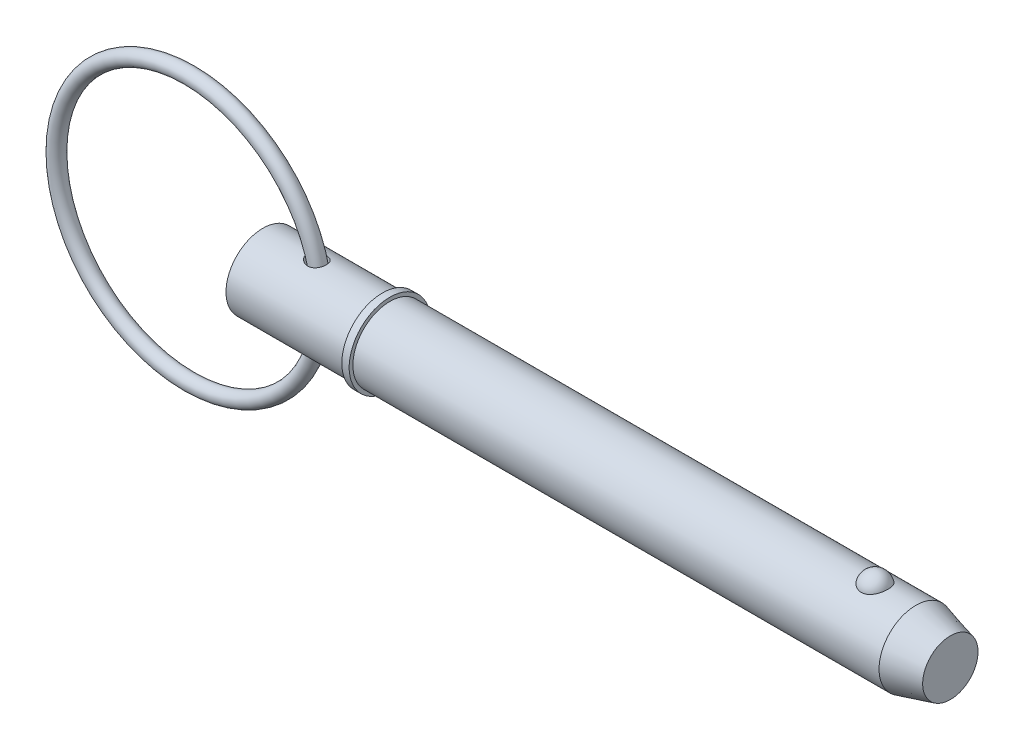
ISO-10303-21;
HEADER;
FILE_DESCRIPTION(('STEP AP214'),'2;1');
FILE_NAME('part.step','',(''),(''),'','','');
FILE_SCHEMA(('AUTOMOTIVE_DESIGN { 1 0 10303 214 1 1 1 1 }'));
ENDSEC;
DATA;
#1=APPLICATION_CONTEXT('core data for automotive mechanical design processes');
#2=APPLICATION_PROTOCOL_DEFINITION('international standard','automotive_design',2000,#1);
#3=PRODUCT_CONTEXT('',#1,'mechanical');
#4=PRODUCT('Part','Part','',(#3));
#5=PRODUCT_RELATED_PRODUCT_CATEGORY('part','',(#4));
#6=PRODUCT_DEFINITION_FORMATION('','',#4);
#7=PRODUCT_DEFINITION_CONTEXT('part definition',#1,'design');
#8=PRODUCT_DEFINITION('design','',#6,#7);
#9=PRODUCT_DEFINITION_SHAPE('','',#8);
#10=(LENGTH_UNIT() NAMED_UNIT(*) SI_UNIT(.MILLI.,.METRE.));
#11=(NAMED_UNIT(*) PLANE_ANGLE_UNIT() SI_UNIT($,.RADIAN.));
#12=(NAMED_UNIT(*) SI_UNIT($,.STERADIAN.) SOLID_ANGLE_UNIT());
#13=UNCERTAINTY_MEASURE_WITH_UNIT(LENGTH_MEASURE(1.E-05),#10,'distance_accuracy_value','');
#14=(GEOMETRIC_REPRESENTATION_CONTEXT(3) GLOBAL_UNCERTAINTY_ASSIGNED_CONTEXT((#13)) GLOBAL_UNIT_ASSIGNED_CONTEXT((#10,
#11,#12)) REPRESENTATION_CONTEXT('',''));
#15=CARTESIAN_POINT('',(0.,0.,0.));
#16=DIRECTION('',(0.,0.,1.));
#17=DIRECTION('',(1.,0.,0.));
#18=AXIS2_PLACEMENT_3D('',#15,#16,#17);
#19=CARTESIAN_POINT('',(-15.855506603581,0.,0.));
#20=DIRECTION('',(0.,0.,1.));
#21=DIRECTION('',(1.,0.,0.));
#22=AXIS2_PLACEMENT_3D('',#19,#20,#21);
#23=TOROIDAL_SURFACE('',#22,28.575,1.588);
#24=CARTESIAN_POINT('',(14.307493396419,0.,0.));
#25=VERTEX_POINT('',#24);
#26=VERTEX_LOOP('',#25);
#27=FACE_BOUND('',#26,.T.);
#28=ADVANCED_FACE('P0_F12',(#27),#23,.T.);
#29=CLOSED_SHELL('',(#28));
#30=MANIFOLD_SOLID_BREP('P0_B1',#29);
#31=CARTESIAN_POINT('',(0.,0.,0.));
#32=DIRECTION('',(1.,0.,0.));
#33=DIRECTION('',(0.,0.,-1.));
#34=AXIS2_PLACEMENT_3D('',#31,#32,#33);
#35=CYLINDRICAL_SURFACE('',#34,7.94);
#36=CARTESIAN_POINT('',(9.9064878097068,7.8609270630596,-1.11777712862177));
#37=CARTESIAN_POINT('',(9.98046148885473,7.84701054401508,-1.21564239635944));
#38=CARTESIAN_POINT('',(10.0632949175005,7.83217804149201,-1.30680329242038));
#39=CARTESIAN_POINT('',(10.243327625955,7.80247884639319,-1.47382688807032));
#40=CARTESIAN_POINT('',(10.3405572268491,7.78761214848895,-1.54965647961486));
#41=CARTESIAN_POINT('',(10.5460150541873,7.75960959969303,-1.6842723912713));
#42=CARTESIAN_POINT('',(10.654212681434,7.74646915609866,-1.74310445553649));
#43=CARTESIAN_POINT('',(10.8789333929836,7.72340979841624,-1.84259563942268));
#44=CARTESIAN_POINT('',(10.9954527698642,7.71348946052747,-1.88326279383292));
#45=CARTESIAN_POINT('',(11.2371543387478,7.69793327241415,-1.94589519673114));
#46=CARTESIAN_POINT('',(11.3624861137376,7.69242163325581,-1.96732022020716));
#47=CARTESIAN_POINT('',(11.6151110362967,7.68708151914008,-1.98809161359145));
#48=CARTESIAN_POINT('',(11.7424035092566,7.68725113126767,-1.98744541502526));
#49=CARTESIAN_POINT('',(11.9871377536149,7.69329740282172,-1.96389977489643));
#50=CARTESIAN_POINT('',(12.1047148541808,7.69883374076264,-1.94232728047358));
#51=CARTESIAN_POINT('',(12.3339179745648,7.7145667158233,-1.87886184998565));
#52=CARTESIAN_POINT('',(12.4455463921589,7.72476145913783,-1.83697717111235));
#53=CARTESIAN_POINT('',(12.6521036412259,7.74778151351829,-1.73721211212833));
#54=CARTESIAN_POINT('',(12.7476463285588,7.76039274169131,-1.68054854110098));
#55=CARTESIAN_POINT('',(12.9274536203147,7.78715828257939,-1.55179691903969));
#56=CARTESIAN_POINT('',(13.0117191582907,7.80131246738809,-1.47971014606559));
#57=CARTESIAN_POINT('',(13.16544092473,7.82932755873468,-1.32341211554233));
#58=CARTESIAN_POINT('',(13.2351086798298,7.84318958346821,-1.23940873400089));
#59=CARTESIAN_POINT('',(13.3595610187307,7.86933512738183,-1.06080152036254));
#60=CARTESIAN_POINT('',(13.4143450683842,7.88161858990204,-0.966197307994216));
#61=CARTESIAN_POINT('',(13.5082288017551,7.90340571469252,-0.767990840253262));
#62=CARTESIAN_POINT('',(13.5471601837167,7.91287927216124,-0.664305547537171));
#63=CARTESIAN_POINT('',(13.6076213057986,7.92785679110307,-0.451705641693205));
#64=CARTESIAN_POINT('',(13.6291504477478,7.93336061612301,-0.3427908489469));
#65=CARTESIAN_POINT('',(13.6544025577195,7.93983472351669,-0.122042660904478));
#66=CARTESIAN_POINT('',(13.6580055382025,7.94077445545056,-0.0101946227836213));
#67=CARTESIAN_POINT('',(13.6469977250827,7.93793630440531,0.212542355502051));
#68=CARTESIAN_POINT('',(13.6323866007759,7.93415833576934,0.323431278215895));
#69=CARTESIAN_POINT('',(13.5852649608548,7.92228583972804,0.541194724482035));
#70=CARTESIAN_POINT('',(13.5527398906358,7.91418780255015,0.648065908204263));
#71=CARTESIAN_POINT('',(13.4705326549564,7.8945509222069,0.854658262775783));
#72=CARTESIAN_POINT('',(13.4208502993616,7.88301204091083,0.954379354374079));
#73=CARTESIAN_POINT('',(13.3056021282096,7.85778224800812,1.14366619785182));
#74=CARTESIAN_POINT('',(13.2400609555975,7.8440946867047,1.23324739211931));
#75=CARTESIAN_POINT('',(13.0946981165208,7.8160855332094,1.39984119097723));
#76=CARTESIAN_POINT('',(13.0148777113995,7.80176399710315,1.47685490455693));
#77=CARTESIAN_POINT('',(12.8438529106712,7.774237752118,1.6154855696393));
#78=CARTESIAN_POINT('',(12.7527554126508,7.76102428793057,1.67723263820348));
#79=CARTESIAN_POINT('',(12.5611987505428,7.73705789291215,1.78453696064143));
#80=CARTESIAN_POINT('',(12.4607407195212,7.72630466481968,1.83009617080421));
#81=CARTESIAN_POINT('',(12.2541997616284,7.70849465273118,1.90371822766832));
#82=CARTESIAN_POINT('',(12.1481665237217,7.7014098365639,1.93191408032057));
#83=CARTESIAN_POINT('',(11.9327851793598,7.69148605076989,1.97105353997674));
#84=CARTESIAN_POINT('',(11.8234367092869,7.68864754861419,1.98199524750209));
#85=CARTESIAN_POINT('',(11.6016024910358,7.68735890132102,1.98698770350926));
#86=CARTESIAN_POINT('',(11.4891069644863,7.68902083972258,1.98060702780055));
#87=CARTESIAN_POINT('',(11.2665484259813,7.6966276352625,1.95083303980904));
#88=CARTESIAN_POINT('',(11.1564861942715,7.70257384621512,1.92743434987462));
#89=CARTESIAN_POINT('',(10.9339966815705,7.71853798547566,1.86251478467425));
#90=CARTESIAN_POINT('',(10.8219140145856,7.72880438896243,1.81987394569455));
#91=CARTESIAN_POINT('',(10.6060441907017,7.75216432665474,1.7176403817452));
#92=CARTESIAN_POINT('',(10.5022611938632,7.76525926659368,1.65803922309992));
#93=CARTESIAN_POINT('',(10.3000447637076,7.79362794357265,1.51929354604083));
#94=CARTESIAN_POINT('',(10.2022480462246,7.80898310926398,1.4392327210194));
#95=CARTESIAN_POINT('',(10.0221668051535,7.83939672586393,1.26310118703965));
#96=CARTESIAN_POINT('',(9.93988168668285,7.85445518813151,1.16703109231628));
#97=CARTESIAN_POINT('',(9.79729823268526,7.88178950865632,0.964874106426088));
#98=CARTESIAN_POINT('',(9.73627994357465,7.89414970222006,0.859310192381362));
#99=CARTESIAN_POINT('',(9.63554001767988,7.91508909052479,0.638143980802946));
#100=CARTESIAN_POINT('',(9.59578986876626,7.92367334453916,0.52255536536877));
#101=CARTESIAN_POINT('',(9.54388714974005,7.93499161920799,0.300466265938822));
#102=CARTESIAN_POINT('',(9.52888458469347,7.93832727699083,0.194660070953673));
#103=CARTESIAN_POINT('',(9.51823078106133,7.94068976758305,-0.0179747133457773));
#104=CARTESIAN_POINT('',(9.52257317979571,7.93971801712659,-0.124802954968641));
#105=CARTESIAN_POINT('',(9.54911264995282,7.93386114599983,-0.326814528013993));
#106=CARTESIAN_POINT('',(9.56976509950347,7.92931471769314,-0.422217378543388));
#107=CARTESIAN_POINT('',(9.62591284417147,7.91721462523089,-0.608271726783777));
#108=CARTESIAN_POINT('',(9.66139801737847,7.90966301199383,-0.698926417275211));
#109=CARTESIAN_POINT('',(9.7317197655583,7.89515389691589,-0.844763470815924));
#110=CARTESIAN_POINT('',(9.76292633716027,7.88881879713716,-0.90180107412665));
#111=CARTESIAN_POINT('',(9.83075962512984,7.87538342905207,-1.01244242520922));
#112=CARTESIAN_POINT('',(9.86738597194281,7.86828321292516,-1.06604640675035));
#113=CARTESIAN_POINT('',(9.9064878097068,7.8609270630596,-1.11777712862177));
#114=B_SPLINE_CURVE_WITH_KNOTS('',3,(#36,#37,#38,#39,#40,#41,#42,#43,#44,#45,#46,#47,#48,#49,
#50,#51,#52,#53,#54,#55,#56,#57,#58,#59,#60,#61,#62,#63,#64,#65,#66,#67,#68,#69,#70,#71,#72,#73,
#74,#75,#76,#77,#78,#79,#80,#81,#82,#83,#84,#85,#86,#87,#88,#89,#90,#91,#92,#93,#94,#95,#96,#97,
#98,#99,#100,#101,#102,#103,#104,#105,#106,#107,#108,#109,#110,#111,#112,#113),.UNSPECIFIED.,
.T.,.F.,(4,2,2,2,2,2,2,2,2,2,2,2,2,2,2,2,2,2,2,2,2,2,2,2,2,2,2,2,2,2,2,2,2,2,2,2,2,2,4),(0.,
0.370138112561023,0.741067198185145,1.11098852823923,1.48074607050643,1.86058657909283,
2.24029919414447,2.59740885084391,2.95437345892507,3.2881332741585,3.62186544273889,
3.95036374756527,4.27887384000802,4.61078596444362,4.94270949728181,5.27685177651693,
5.61100012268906,5.94542035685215,6.27984429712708,6.61375187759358,6.94762997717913,
7.27855592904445,7.60944187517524,7.93776058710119,8.26611544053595,8.60272268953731,
8.93943635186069,9.29895306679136,9.65864886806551,10.0387340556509,10.4188046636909,
10.7843533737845,11.1494107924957,11.4683925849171,11.7872694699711,12.0791172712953,
12.3707662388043,12.5664313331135,12.7620830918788),.UNSPECIFIED.);
#115=CARTESIAN_POINT('',(9.9064878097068,7.8609270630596,-1.11777712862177));
#116=VERTEX_POINT('',#115);
#117=EDGE_CURVE('P1_E42',#116,#116,#114,.T.);
#118=ORIENTED_EDGE('',*,*,#117,.T.);
#119=EDGE_LOOP('',(#118));
#120=FACE_BOUND('',#119,.T.);
#121=CARTESIAN_POINT('',(0.,0.,0.));
#122=DIRECTION('',(1.,0.,0.));
#123=DIRECTION('',(0.,0.,-1.));
#124=AXIS2_PLACEMENT_3D('',#121,#122,#123);
#125=CIRCLE('',#124,7.94);
#126=CARTESIAN_POINT('',(0.,0.,-7.94));
#127=VERTEX_POINT('',#126);
#128=EDGE_CURVE('P1_E9',#127,#127,#125,.T.);
#129=ORIENTED_EDGE('',*,*,#128,.T.);
#130=EDGE_LOOP('',(#129));
#131=FACE_BOUND('',#130,.T.);
#132=CARTESIAN_POINT('',(25.722,0.,0.));
#133=DIRECTION('',(1.,0.,0.));
#134=DIRECTION('',(0.,0.,-1.));
#135=AXIS2_PLACEMENT_3D('',#132,#133,#134);
#136=CIRCLE('',#135,7.94);
#137=CARTESIAN_POINT('',(25.722,0.,-7.94));
#138=VERTEX_POINT('',#137);
#139=EDGE_CURVE('P1_E25',#138,#138,#136,.T.);
#140=ORIENTED_EDGE('',*,*,#139,.F.);
#141=EDGE_LOOP('',(#140));
#142=FACE_BOUND('',#141,.T.);
#143=CARTESIAN_POINT('',(9.9064878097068,-7.8609270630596,-1.11777712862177));
#144=CARTESIAN_POINT('',(9.84378768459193,-7.87272256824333,-1.03482250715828));
#145=CARTESIAN_POINT('',(9.7874122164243,-7.88386682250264,-0.947002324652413));
#146=CARTESIAN_POINT('',(9.68947008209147,-7.90377389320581,-0.763202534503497));
#147=CARTESIAN_POINT('',(9.64789384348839,-7.91253824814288,-0.667228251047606));
#148=CARTESIAN_POINT('',(9.58141396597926,-7.92676779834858,-0.46889851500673));
#149=CARTESIAN_POINT('',(9.55658638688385,-7.93221793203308,-0.36651622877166));
#150=CARTESIAN_POINT('',(9.525398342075,-7.9390896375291,-0.158837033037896));
#151=CARTESIAN_POINT('',(9.51903196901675,-7.94051249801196,-0.0535410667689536));
#152=CARTESIAN_POINT('',(9.5249639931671,-7.93919670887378,0.149856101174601));
#153=CARTESIAN_POINT('',(9.53611757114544,-7.9367132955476,0.24799461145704));
#154=CARTESIAN_POINT('',(9.57435037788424,-7.92833496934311,0.44094918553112));
#155=CARTESIAN_POINT('',(9.60143086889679,-7.92243978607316,0.535764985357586));
#156=CARTESIAN_POINT('',(9.67027872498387,-7.90782830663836,0.720026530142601));
#157=CARTESIAN_POINT('',(9.71210005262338,-7.89910165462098,0.809451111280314));
#158=CARTESIAN_POINT('',(9.80864905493,-7.87966534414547,0.980775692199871));
#159=CARTESIAN_POINT('',(9.86338092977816,-7.86895504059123,1.06267323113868));
#160=CARTESIAN_POINT('',(9.99009906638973,-7.84531573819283,1.22559225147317));
#161=CARTESIAN_POINT('',(10.0632770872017,-7.8322718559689,1.30566871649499));
#162=CARTESIAN_POINT('',(10.2208237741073,-7.80611237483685,1.45392159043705));
#163=CARTESIAN_POINT('',(10.3051986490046,-7.79299674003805,1.52209134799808));
#164=CARTESIAN_POINT('',(10.4935539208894,-7.76638841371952,1.65280871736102));
#165=CARTESIAN_POINT('',(10.5986730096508,-7.75303312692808,1.71374951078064));
#166=CARTESIAN_POINT('',(10.8175805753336,-7.72920597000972,1.81820073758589));
#167=CARTESIAN_POINT('',(10.9313721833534,-7.71873514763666,1.86170483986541));
#168=CARTESIAN_POINT('',(11.1696833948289,-7.70161777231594,1.93133079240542));
#169=CARTESIAN_POINT('',(11.2944525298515,-7.69514907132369,1.95665138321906));
#170=CARTESIAN_POINT('',(11.5466607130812,-7.6877908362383,1.98537345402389));
#171=CARTESIAN_POINT('',(11.6740986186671,-7.68689896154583,1.98878412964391));
#172=CARTESIAN_POINT('',(11.9206005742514,-7.690938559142,1.97309854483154));
#173=CARTESIAN_POINT('',(12.0397453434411,-7.69555832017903,1.95520713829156));
#174=CARTESIAN_POINT('',(12.2727177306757,-7.70968728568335,1.89872693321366));
#175=CARTESIAN_POINT('',(12.3865475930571,-7.71919440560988,1.86014695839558));
#176=CARTESIAN_POINT('',(12.5975118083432,-7.74115679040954,1.76641559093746));
#177=CARTESIAN_POINT('',(12.6952552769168,-7.75336701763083,1.71257254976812));
#178=CARTESIAN_POINT('',(12.8798510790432,-7.77962828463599,1.58901145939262));
#179=CARTESIAN_POINT('',(12.9667044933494,-7.79367914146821,1.51929498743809));
#180=CARTESIAN_POINT('',(13.1254818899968,-7.82172079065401,1.36751778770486));
#181=CARTESIAN_POINT('',(13.1976693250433,-7.83570718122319,1.28573131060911));
#182=CARTESIAN_POINT('',(13.3274495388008,-7.86236718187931,1.11111271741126));
#183=CARTESIAN_POINT('',(13.3850418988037,-7.87504075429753,1.01828028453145));
#184=CARTESIAN_POINT('',(13.4847470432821,-7.89782512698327,0.823214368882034));
#185=CARTESIAN_POINT('',(13.5267056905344,-7.90791011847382,0.72089908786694));
#186=CARTESIAN_POINT('',(13.5933891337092,-7.92427335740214,0.510509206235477));
#187=CARTESIAN_POINT('',(13.6181132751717,-7.9305514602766,0.40243438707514));
#188=CARTESIAN_POINT('',(13.6498843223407,-7.93866355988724,0.182728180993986));
#189=CARTESIAN_POINT('',(13.6567982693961,-7.94046412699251,0.0710763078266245));
#190=CARTESIAN_POINT('',(13.6524060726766,-7.93933046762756,-0.151845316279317));
#191=CARTESIAN_POINT('',(13.6410996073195,-7.93639615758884,-0.263115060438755));
#192=CARTESIAN_POINT('',(13.6005023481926,-7.92610202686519,-0.482238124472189));
#193=CARTESIAN_POINT('',(13.571192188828,-7.91873744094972,-0.590087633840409));
#194=CARTESIAN_POINT('',(13.495246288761,-7.90037565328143,-0.799178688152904));
#195=CARTESIAN_POINT('',(13.4486102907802,-7.88937839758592,-0.900420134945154));
#196=CARTESIAN_POINT('',(13.3391817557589,-7.86497175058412,-1.09328280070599));
#197=CARTESIAN_POINT('',(13.2764083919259,-7.85156522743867,-1.18491525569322));
#198=CARTESIAN_POINT('',(13.1362355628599,-7.8238261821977,-1.35604994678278));
#199=CARTESIAN_POINT('',(13.0588372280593,-7.80949373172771,-1.43555311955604));
#200=CARTESIAN_POINT('',(12.8921392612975,-7.78164292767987,-1.57955181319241));
#201=CARTESIAN_POINT('',(12.8029410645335,-7.76811892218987,-1.64416363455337));
#202=CARTESIAN_POINT('',(12.6146622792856,-7.74328422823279,-1.75742016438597));
#203=CARTESIAN_POINT('',(12.5155829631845,-7.73197325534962,-1.80606692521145));
#204=CARTESIAN_POINT('',(12.31135301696,-7.71289290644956,-1.88588502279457));
#205=CARTESIAN_POINT('',(12.2062651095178,-7.70509254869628,-1.91720981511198));
#206=CARTESIAN_POINT('',(11.9922253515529,-7.69365188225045,-1.96261878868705));
#207=CARTESIAN_POINT('',(11.8832731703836,-7.69001193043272,-1.97670149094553));
#208=CARTESIAN_POINT('',(11.662174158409,-7.6871142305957,-1.98794112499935));
#209=CARTESIAN_POINT('',(11.5500082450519,-7.6879499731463,-1.98473694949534));
#210=CARTESIAN_POINT('',(11.3276038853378,-7.69396349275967,-1.96129119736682));
#211=CARTESIAN_POINT('',(11.2173659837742,-7.6991424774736,-1.94104488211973));
#212=CARTESIAN_POINT('',(10.9943151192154,-7.71363470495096,-1.8826578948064));
#213=CARTESIAN_POINT('',(10.8818004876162,-7.72319478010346,-1.8434396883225));
#214=CARTESIAN_POINT('',(10.6644693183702,-7.74534199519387,-1.74804607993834));
#215=CARTESIAN_POINT('',(10.5596578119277,-7.75793109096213,-1.69185971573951));
#216=CARTESIAN_POINT('',(10.3538333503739,-7.78563853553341,-1.55958016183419));
#217=CARTESIAN_POINT('',(10.2535123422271,-7.80086820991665,-1.48242881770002));
#218=CARTESIAN_POINT('',(10.0678634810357,-7.83136022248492,-1.31182139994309));
#219=CARTESIAN_POINT('',(9.98252491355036,-7.84662252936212,-1.21837707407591));
#220=CARTESIAN_POINT('',(9.9064878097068,-7.8609270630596,-1.11777712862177));
#221=B_SPLINE_CURVE_WITH_KNOTS('',3,(#143,#144,#145,#146,#147,#148,#149,#150,#151,#152,#153,
#154,#155,#156,#157,#158,#159,#160,#161,#162,#163,#164,#165,#166,#167,#168,#169,#170,#171,#172,
#173,#174,#175,#176,#177,#178,#179,#180,#181,#182,#183,#184,#185,#186,#187,#188,#189,#190,#191,
#192,#193,#194,#195,#196,#197,#198,#199,#200,#201,#202,#203,#204,#205,#206,#207,#208,#209,#210,
#211,#212,#213,#214,#215,#216,#217,#218,#219,#220),.UNSPECIFIED.,.T.,.F.,(4,2,2,2,2,2,2,2,2,2,2,
2,2,2,2,2,2,2,2,2,2,2,2,2,2,2,2,2,2,2,2,2,2,2,2,2,2,2,4),(0.,0.313593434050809,
0.626983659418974,0.941787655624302,1.25649090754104,1.55146990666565,1.84647228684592,
2.14256601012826,2.43875619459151,2.76521830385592,3.09186220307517,3.45696288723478,
3.82219601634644,4.20267276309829,4.58298981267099,4.94277962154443,5.30241610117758,
5.63754619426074,5.9726430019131,6.30104941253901,6.62946524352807,6.96103833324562,
7.29262401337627,7.62667800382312,7.96073789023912,8.29515773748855,8.62958255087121,
8.96361184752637,9.29761533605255,9.62891449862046,9.96017105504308,10.288443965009,
10.616745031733,10.951930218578,11.2872086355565,11.6442788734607,12.0015802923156,
12.3821516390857,12.762449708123),.UNSPECIFIED.);
#222=CARTESIAN_POINT('',(9.9064878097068,-7.8609270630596,-1.11777712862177));
#223=VERTEX_POINT('',#222);
#224=EDGE_CURVE('P1_E17',#223,#223,#221,.T.);
#225=ORIENTED_EDGE('',*,*,#224,.T.);
#226=EDGE_LOOP('',(#225));
#227=FACE_BOUND('',#226,.T.);
#228=ADVANCED_FACE('P1_F13',(#120,#131,#142,#227),#35,.T.);
#229=CARTESIAN_POINT('',(0.,0.,0.));
#230=DIRECTION('',(1.,0.,0.));
#231=DIRECTION('',(0.,0.,-1.));
#232=AXIS2_PLACEMENT_3D('',#229,#230,#231);
#233=CYLINDRICAL_SURFACE('',#232,7.94);
#234=CARTESIAN_POINT('',(140.551879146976,0.,0.));
#235=DIRECTION('',(1.,0.,0.));
#236=DIRECTION('',(0.,0.,-1.));
#237=AXIS2_PLACEMENT_3D('',#234,#235,#236);
#238=CIRCLE('',#237,7.94);
#239=CARTESIAN_POINT('',(140.551879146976,0.,-7.94));
#240=VERTEX_POINT('',#239);
#241=EDGE_CURVE('P1_E99',#240,#240,#238,.T.);
#242=ORIENTED_EDGE('',*,*,#241,.F.);
#243=EDGE_LOOP('',(#242));
#244=FACE_BOUND('',#243,.T.);
#245=CARTESIAN_POINT('',(27.31,0.,0.));
#246=DIRECTION('',(1.,0.,0.));
#247=DIRECTION('',(0.,0.,-1.));
#248=AXIS2_PLACEMENT_3D('',#245,#246,#247);
#249=CIRCLE('',#248,7.94);
#250=CARTESIAN_POINT('',(27.31,0.,-7.94));
#251=VERTEX_POINT('',#250);
#252=EDGE_CURVE('P1_E96',#251,#251,#249,.T.);
#253=ORIENTED_EDGE('',*,*,#252,.T.);
#254=EDGE_LOOP('',(#253));
#255=FACE_BOUND('',#254,.T.);
#256=CARTESIAN_POINT('',(131.744907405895,7.37767842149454,2.93486986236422));
#257=CARTESIAN_POINT('',(131.592749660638,7.3776732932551,2.93487505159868));
#258=CARTESIAN_POINT('',(131.440632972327,7.38258419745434,2.92262454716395));
#259=CARTESIAN_POINT('',(131.140928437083,7.40163229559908,2.87404196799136));
#260=CARTESIAN_POINT('',(130.993339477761,7.41576720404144,2.83771585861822));
#261=CARTESIAN_POINT('',(130.707018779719,7.45161576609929,2.74218769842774));
#262=CARTESIAN_POINT('',(130.568274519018,7.47331841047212,2.68301886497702));
#263=CARTESIAN_POINT('',(130.302882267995,7.52194082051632,2.54350967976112));
#264=CARTESIAN_POINT('',(130.176236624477,7.54886159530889,2.46316523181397));
#265=CARTESIAN_POINT('',(129.934534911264,7.60594671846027,2.28090375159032));
#266=CARTESIAN_POINT('',(129.819906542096,7.63618114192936,2.1784421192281));
#267=CARTESIAN_POINT('',(129.608878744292,7.69614046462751,1.95608495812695));
#268=CARTESIAN_POINT('',(129.512482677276,7.72586526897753,1.83618622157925));
#269=CARTESIAN_POINT('',(129.335938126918,7.78314821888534,1.57628086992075));
#270=CARTESIAN_POINT('',(129.256707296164,7.81055035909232,1.43561546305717));
#271=CARTESIAN_POINT('',(129.121797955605,7.85879631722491,1.142363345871));
#272=CARTESIAN_POINT('',(129.066121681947,7.87963951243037,0.989775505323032));
#273=CARTESIAN_POINT('',(128.97881215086,7.91289645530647,0.674619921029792));
#274=CARTESIAN_POINT('',(128.94753090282,7.92518652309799,0.511941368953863));
#275=CARTESIAN_POINT('',(128.910975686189,7.93958930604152,0.183247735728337));
#276=CARTESIAN_POINT('',(128.905701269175,7.94170219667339,0.0172327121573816));
#277=CARTESIAN_POINT('',(128.921231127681,7.93554931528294,-0.312672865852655));
#278=CARTESIAN_POINT('',(128.941925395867,7.92732732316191,-0.476569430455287));
#279=CARTESIAN_POINT('',(129.00878655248,7.90141534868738,-0.798305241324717));
#280=CARTESIAN_POINT('',(129.054953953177,7.88372517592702,-0.956144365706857));
#281=CARTESIAN_POINT('',(129.171898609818,7.84066230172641,-1.26152073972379));
#282=CARTESIAN_POINT('',(129.242704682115,7.81528060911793,-1.40904568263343));
#283=CARTESIAN_POINT('',(129.407478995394,7.75948672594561,-1.68950598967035));
#284=CARTESIAN_POINT('',(129.501448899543,7.72907417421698,-1.82244030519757));
#285=CARTESIAN_POINT('',(129.710839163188,7.66640424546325,-2.07032792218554));
#286=CARTESIAN_POINT('',(129.826315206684,7.63414223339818,-2.18523308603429));
#287=CARTESIAN_POINT('',(130.0759006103,7.57149681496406,-2.39329737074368));
#288=CARTESIAN_POINT('',(130.210008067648,7.54111321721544,-2.48645870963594));
#289=CARTESIAN_POINT('',(130.490111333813,7.48650742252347,-2.64628132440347));
#290=CARTESIAN_POINT('',(130.635760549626,7.46215900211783,-2.71350554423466));
#291=CARTESIAN_POINT('',(130.937425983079,7.42171253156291,-2.82226614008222));
#292=CARTESIAN_POINT('',(131.093438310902,7.40561140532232,-2.86381209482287));
#293=CARTESIAN_POINT('',(131.402970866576,7.3842679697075,-2.9183907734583));
#294=CARTESIAN_POINT('',(131.556222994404,7.37852109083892,-2.93275024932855));
#295=CARTESIAN_POINT('',(131.863070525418,7.37700973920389,-2.93655208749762));
#296=CARTESIAN_POINT('',(132.016665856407,7.38124333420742,-2.92599927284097));
#297=CARTESIAN_POINT('',(132.314990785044,7.39890635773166,-2.88102897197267));
#298=CARTESIAN_POINT('',(132.459848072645,7.41205491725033,-2.84733999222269));
#299=CARTESIAN_POINT('',(132.74164329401,7.445801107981,-2.75788206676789));
#300=CARTESIAN_POINT('',(132.878580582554,7.46639934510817,-2.70211132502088));
#301=CARTESIAN_POINT('',(133.144061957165,7.51339098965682,-2.56858908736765));
#302=CARTESIAN_POINT('',(133.272354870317,7.53990200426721,-2.4903806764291));
#303=CARTESIAN_POINT('',(133.514244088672,7.59569503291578,-2.31462737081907));
#304=CARTESIAN_POINT('',(133.627837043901,7.6249776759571,-2.21707808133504));
#305=CARTESIAN_POINT('',(133.84322156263,7.68489473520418,-1.99982049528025));
#306=CARTESIAN_POINT('',(133.944148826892,7.71552419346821,-1.87925337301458));
#307=CARTESIAN_POINT('',(134.125186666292,7.77353016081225,-1.6226882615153));
#308=CARTESIAN_POINT('',(134.205293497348,7.80090608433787,-1.48668750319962));
#309=CARTESIAN_POINT('',(134.345361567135,7.85047992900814,-1.1981841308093));
#310=CARTESIAN_POINT('',(134.404587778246,7.87248183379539,-1.04529016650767));
#311=CARTESIAN_POINT('',(134.497982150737,7.90785114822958,-0.731080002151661));
#312=CARTESIAN_POINT('',(134.532149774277,7.92121837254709,-0.569763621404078));
#313=CARTESIAN_POINT('',(134.574795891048,7.93797834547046,-0.242812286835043));
#314=CARTESIAN_POINT('',(134.583204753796,7.94134405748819,-0.0771668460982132));
#315=CARTESIAN_POINT('',(134.573962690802,7.93767937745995,0.253276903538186));
#316=CARTESIAN_POINT('',(134.556312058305,7.93064910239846,0.418075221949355));
#317=CARTESIAN_POINT('',(134.495424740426,7.90695571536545,0.741525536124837));
#318=CARTESIAN_POINT('',(134.452281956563,7.8903279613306,0.900197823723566));
#319=CARTESIAN_POINT('',(134.34135358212,7.84916386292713,1.20759654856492));
#320=CARTESIAN_POINT('',(134.27356656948,7.82462706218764,1.35632241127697));
#321=CARTESIAN_POINT('',(134.114371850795,7.7700669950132,1.64032869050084));
#322=CARTESIAN_POINT('',(134.022861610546,7.74002008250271,1.7755471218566));
#323=CARTESIAN_POINT('',(133.818296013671,7.67774175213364,2.0280064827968));
#324=CARTESIAN_POINT('',(133.705241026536,7.64551037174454,2.14524772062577));
#325=CARTESIAN_POINT('',(133.460831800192,7.58265895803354,2.35778002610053));
#326=CARTESIAN_POINT('',(133.329583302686,7.5520309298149,2.45319004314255));
#327=CARTESIAN_POINT('',(133.051601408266,7.49579792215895,2.61999897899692));
#328=CARTESIAN_POINT('',(132.904867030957,7.4701932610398,2.69139637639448));
#329=CARTESIAN_POINT('',(132.592947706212,7.42622216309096,2.8105324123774));
#330=CARTESIAN_POINT('',(132.427220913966,7.40825002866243,2.85700910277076));
#331=CARTESIAN_POINT('',(132.089279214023,7.38398348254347,2.9191685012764));
#332=CARTESIAN_POINT('',(131.91706702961,7.3776842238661,2.93486399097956));
#333=CARTESIAN_POINT('',(131.744907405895,7.37767842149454,2.93486986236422));
#334=B_SPLINE_CURVE_WITH_KNOTS('',3,(#256,#257,#258,#259,#260,#261,#262,#263,#264,#265,#266,
#267,#268,#269,#270,#271,#272,#273,#274,#275,#276,#277,#278,#279,#280,#281,#282,#283,#284,#285,
#286,#287,#288,#289,#290,#291,#292,#293,#294,#295,#296,#297,#298,#299,#300,#301,#302,#303,#304,
#305,#306,#307,#308,#309,#310,#311,#312,#313,#314,#315,#316,#317,#318,#319,#320,#321,#322,#323,
#324,#325,#326,#327,#328,#329,#330,#331,#332,#333),.UNSPECIFIED.,.T.,.F.,(4,2,2,2,2,2,2,2,2,2,2,
2,2,2,2,2,2,2,2,2,2,2,2,2,2,2,2,2,2,2,2,2,2,2,2,2,2,2,4),(0.,0.455841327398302,
0.911569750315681,1.36663794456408,1.82179423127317,2.2897898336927,2.75787163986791,
3.24685368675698,3.73588214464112,4.23184282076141,4.72779494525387,5.22165321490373,
5.71552141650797,6.20996917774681,6.70445245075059,7.20023431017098,7.6959655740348,
8.18023418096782,8.66432203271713,9.1241069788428,9.58380291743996,10.0296503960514,
10.4755341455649,10.9312349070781,11.3870393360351,11.8654416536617,12.3439299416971,
12.8378875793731,13.3318558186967,13.8271581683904,14.3224549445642,14.8159385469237,
15.3094506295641,15.8051323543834,16.3008055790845,16.7937101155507,17.2866458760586,
17.8026240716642,18.3183879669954),.UNSPECIFIED.);
#335=CARTESIAN_POINT('',(131.744907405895,7.37767842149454,2.93486986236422));
#336=VERTEX_POINT('',#335);
#337=EDGE_CURVE('P1_E34',#336,#336,#334,.T.);
#338=ORIENTED_EDGE('',*,*,#337,.T.);
#339=EDGE_LOOP('',(#338));
#340=FACE_BOUND('',#339,.T.);
#341=ADVANCED_FACE('P1_F46',(#244,#255,#340),#233,.T.);
#342=CARTESIAN_POINT('',(0.,0.,0.));
#343=DIRECTION('',(-1.,0.,0.));
#344=DIRECTION('',(0.,0.,1.));
#345=AXIS2_PLACEMENT_3D('',#342,#343,#344);
#346=PLANE('',#345);
#347=ORIENTED_EDGE('',*,*,#128,.F.);
#348=EDGE_LOOP('',(#347));
#349=FACE_BOUND('',#348,.T.);
#350=ADVANCED_FACE('P1_F15',(#349),#346,.T.);
#351=CARTESIAN_POINT('',(25.722,7.94,0.));
#352=DIRECTION('',(-1.,0.,0.));
#353=DIRECTION('',(0.,0.,1.));
#354=AXIS2_PLACEMENT_3D('',#351,#352,#353);
#355=PLANE('',#354);
#356=ORIENTED_EDGE('',*,*,#139,.T.);
#357=EDGE_LOOP('',(#356));
#358=FACE_BOUND('',#357,.T.);
#359=CARTESIAN_POINT('',(25.722,0.,0.));
#360=DIRECTION('',(1.,0.,0.));
#361=DIRECTION('',(0.,0.,-1.));
#362=AXIS2_PLACEMENT_3D('',#359,#360,#361);
#363=CIRCLE('',#362,8.734);
#364=CARTESIAN_POINT('',(25.722,0.,-8.734));
#365=VERTEX_POINT('',#364);
#366=EDGE_CURVE('P1_E30',#365,#365,#363,.T.);
#367=ORIENTED_EDGE('',*,*,#366,.F.);
#368=EDGE_LOOP('',(#367));
#369=FACE_BOUND('',#368,.T.);
#370=ADVANCED_FACE('P1_F81',(#358,#369),#355,.T.);
#371=CARTESIAN_POINT('',(0.,0.,0.));
#372=DIRECTION('',(1.,0.,0.));
#373=DIRECTION('',(0.,0.,-1.));
#374=AXIS2_PLACEMENT_3D('',#371,#372,#373);
#375=CYLINDRICAL_SURFACE('',#374,8.734);
#376=ORIENTED_EDGE('',*,*,#366,.T.);
#377=EDGE_LOOP('',(#376));
#378=FACE_BOUND('',#377,.T.);
#379=CARTESIAN_POINT('',(27.31,0.,0.));
#380=DIRECTION('',(1.,0.,0.));
#381=DIRECTION('',(0.,0.,-1.));
#382=AXIS2_PLACEMENT_3D('',#379,#380,#381);
#383=CIRCLE('',#382,8.734);
#384=CARTESIAN_POINT('',(27.31,0.,-8.734));
#385=VERTEX_POINT('',#384);
#386=EDGE_CURVE('P1_E95',#385,#385,#383,.T.);
#387=ORIENTED_EDGE('',*,*,#386,.F.);
#388=EDGE_LOOP('',(#387));
#389=FACE_BOUND('',#388,.T.);
#390=ADVANCED_FACE('P1_F68',(#378,#389),#375,.T.);
#391=CARTESIAN_POINT('',(27.31,8.734,0.));
#392=DIRECTION('',(1.,0.,0.));
#393=DIRECTION('',(0.,0.,-1.));
#394=AXIS2_PLACEMENT_3D('',#391,#392,#393);
#395=PLANE('',#394);
#396=ORIENTED_EDGE('',*,*,#386,.T.);
#397=EDGE_LOOP('',(#396));
#398=FACE_BOUND('',#397,.T.);
#399=ORIENTED_EDGE('',*,*,#252,.F.);
#400=EDGE_LOOP('',(#399));
#401=FACE_BOUND('',#400,.T.);
#402=ADVANCED_FACE('P1_F62',(#398,#401),#395,.T.);
#403=CARTESIAN_POINT('',(147.96,0.,0.));
#404=DIRECTION('',(-1.,0.,0.));
#405=DIRECTION('',(0.,0.,1.));
#406=AXIS2_PLACEMENT_3D('',#403,#404,#405);
#407=CONICAL_SURFACE('',#406,5.95500000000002,0.261799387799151);
#408=ORIENTED_EDGE('',*,*,#241,.T.);
#409=EDGE_LOOP('',(#408));
#410=FACE_BOUND('',#409,.T.);
#411=CARTESIAN_POINT('',(147.96,0.,0.));
#412=DIRECTION('',(1.,0.,0.));
#413=DIRECTION('',(0.,0.,-1.));
#414=AXIS2_PLACEMENT_3D('',#411,#412,#413);
#415=CIRCLE('',#414,5.95500000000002);
#416=CARTESIAN_POINT('',(147.96,0.,-5.95500000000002));
#417=VERTEX_POINT('',#416);
#418=EDGE_CURVE('P1_E41',#417,#417,#415,.T.);
#419=ORIENTED_EDGE('',*,*,#418,.F.);
#420=EDGE_LOOP('',(#419));
#421=FACE_BOUND('',#420,.T.);
#422=ADVANCED_FACE('P1_F59',(#410,#421),#407,.T.);
#423=CARTESIAN_POINT('',(147.96,5.95500000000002,0.));
#424=DIRECTION('',(1.,0.,0.));
#425=DIRECTION('',(0.,0.,-1.));
#426=AXIS2_PLACEMENT_3D('',#423,#424,#425);
#427=PLANE('',#426);
#428=ORIENTED_EDGE('',*,*,#418,.T.);
#429=EDGE_LOOP('',(#428));
#430=FACE_BOUND('',#429,.T.);
#431=ADVANCED_FACE('P1_F55',(#430),#427,.T.);
#432=CARTESIAN_POINT('',(131.744907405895,7.14599999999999,0.));
#433=DIRECTION('',(-1.,0.,0.));
#434=DIRECTION('',(0.,-1.,0.));
#435=AXIS2_PLACEMENT_3D('',#432,#433,#434);
#436=SPHERICAL_SURFACE('',#435,2.944);
#437=ORIENTED_EDGE('',*,*,#337,.F.);
#438=EDGE_LOOP('',(#437));
#439=FACE_BOUND('',#438,.T.);
#440=ADVANCED_FACE('P1_F50',(#439),#436,.T.);
#441=CARTESIAN_POINT('',(-15.855506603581,0.,0.));
#442=DIRECTION('',(0.,0.,1.));
#443=DIRECTION('',(1.,0.,0.));
#444=AXIS2_PLACEMENT_3D('',#441,#442,#443);
#445=TOROIDAL_SURFACE('',#444,28.575,1.985);
#446=ORIENTED_EDGE('',*,*,#224,.F.);
#447=EDGE_LOOP('',(#446));
#448=FACE_BOUND('',#447,.T.);
#449=ORIENTED_EDGE('',*,*,#117,.F.);
#450=EDGE_LOOP('',(#449));
#451=FACE_BOUND('',#450,.T.);
#452=ADVANCED_FACE('P1_F54',(#448,#451),#445,.F.);
#453=CLOSED_SHELL('',(#228,#341,#350,#370,#390,#402,#422,#431,#440,#452));
#454=MANIFOLD_SOLID_BREP('P1_B1',#453);
#455=ADVANCED_BREP_SHAPE_REPRESENTATION('',(#18,#30,#454),#14);
#456=SHAPE_DEFINITION_REPRESENTATION(#9,#455);
ENDSEC;
END-ISO-10303-21;
